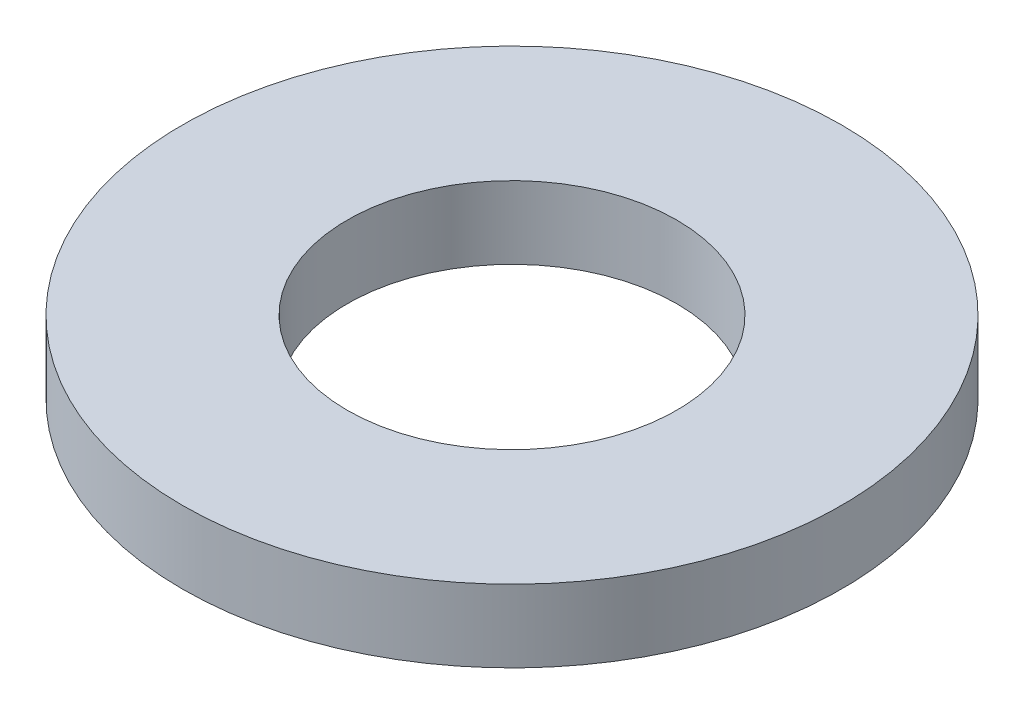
ISO-10303-21;
HEADER;
FILE_DESCRIPTION(('STEP AP214'),'2;1');
FILE_NAME('part.step','',(''),(''),'','','');
FILE_SCHEMA(('AUTOMOTIVE_DESIGN { 1 0 10303 214 1 1 1 1 }'));
ENDSEC;
DATA;
#1=APPLICATION_CONTEXT('core data for automotive mechanical design processes');
#2=APPLICATION_PROTOCOL_DEFINITION('international standard','automotive_design',2000,#1);
#3=PRODUCT_CONTEXT('',#1,'mechanical');
#4=PRODUCT('Part','Part','',(#3));
#5=PRODUCT_RELATED_PRODUCT_CATEGORY('part','',(#4));
#6=PRODUCT_DEFINITION_FORMATION('','',#4);
#7=PRODUCT_DEFINITION_CONTEXT('part definition',#1,'design');
#8=PRODUCT_DEFINITION('design','',#6,#7);
#9=PRODUCT_DEFINITION_SHAPE('','',#8);
#10=(LENGTH_UNIT() NAMED_UNIT(*) SI_UNIT(.MILLI.,.METRE.));
#11=(NAMED_UNIT(*) PLANE_ANGLE_UNIT() SI_UNIT($,.RADIAN.));
#12=(NAMED_UNIT(*) SI_UNIT($,.STERADIAN.) SOLID_ANGLE_UNIT());
#13=UNCERTAINTY_MEASURE_WITH_UNIT(LENGTH_MEASURE(1.E-05),#10,'distance_accuracy_value','');
#14=(GEOMETRIC_REPRESENTATION_CONTEXT(3) GLOBAL_UNCERTAINTY_ASSIGNED_CONTEXT((#13)) GLOBAL_UNIT_ASSIGNED_CONTEXT((#10,
#11,#12)) REPRESENTATION_CONTEXT('',''));
#15=CARTESIAN_POINT('',(0.,0.,0.));
#16=DIRECTION('',(0.,0.,1.));
#17=DIRECTION('',(1.,0.,0.));
#18=AXIS2_PLACEMENT_3D('',#15,#16,#17);
#19=CARTESIAN_POINT('',(0.,0.,0.));
#20=DIRECTION('',(0.,-1.,0.));
#21=DIRECTION('',(0.,0.,-1.));
#22=AXIS2_PLACEMENT_3D('',#19,#20,#21);
#23=CYLINDRICAL_SURFACE('',#22,5.);
#24=CARTESIAN_POINT('',(0.,0.,0.));
#25=DIRECTION('',(0.,-1.,0.));
#26=DIRECTION('',(0.,0.,-1.));
#27=AXIS2_PLACEMENT_3D('',#24,#25,#26);
#28=CIRCLE('',#27,5.);
#29=CARTESIAN_POINT('',(0.,0.,-5.00000000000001));
#30=VERTEX_POINT('',#29);
#31=EDGE_CURVE('E46',#30,#30,#28,.T.);
#32=ORIENTED_EDGE('',*,*,#31,.T.);
#33=EDGE_LOOP('',(#32));
#34=FACE_BOUND('',#33,.T.);
#35=CARTESIAN_POINT('',(0.,2.20000000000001,0.));
#36=DIRECTION('',(0.,-1.,0.));
#37=DIRECTION('',(0.,0.,-1.));
#38=AXIS2_PLACEMENT_3D('',#35,#36,#37);
#39=CIRCLE('',#38,5.);
#40=CARTESIAN_POINT('',(0.,2.20000000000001,-5.00000000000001));
#41=VERTEX_POINT('',#40);
#42=EDGE_CURVE('E10',#41,#41,#39,.T.);
#43=ORIENTED_EDGE('',*,*,#42,.F.);
#44=EDGE_LOOP('',(#43));
#45=FACE_BOUND('',#44,.T.);
#46=ADVANCED_FACE('F32',(#34,#45),#23,.F.);
#47=CARTESIAN_POINT('',(5.00000000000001,2.20000000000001,0.));
#48=DIRECTION('',(0.,1.,0.));
#49=DIRECTION('',(0.,0.,1.));
#50=AXIS2_PLACEMENT_3D('',#47,#48,#49);
#51=PLANE('',#50);
#52=ORIENTED_EDGE('',*,*,#42,.T.);
#53=EDGE_LOOP('',(#52));
#54=FACE_BOUND('',#53,.T.);
#55=CARTESIAN_POINT('',(0.,2.20000000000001,0.));
#56=DIRECTION('',(0.,-1.,0.));
#57=DIRECTION('',(0.,0.,-1.));
#58=AXIS2_PLACEMENT_3D('',#55,#56,#57);
#59=CIRCLE('',#58,10.);
#60=CARTESIAN_POINT('',(0.,2.20000000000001,-10.));
#61=VERTEX_POINT('',#60);
#62=EDGE_CURVE('E38',#61,#61,#59,.T.);
#63=ORIENTED_EDGE('',*,*,#62,.F.);
#64=EDGE_LOOP('',(#63));
#65=FACE_BOUND('',#64,.T.);
#66=ADVANCED_FACE('F62',(#54,#65),#51,.T.);
#67=CARTESIAN_POINT('',(0.,0.,0.));
#68=DIRECTION('',(0.,-1.,0.));
#69=DIRECTION('',(0.,0.,-1.));
#70=AXIS2_PLACEMENT_3D('',#67,#68,#69);
#71=CYLINDRICAL_SURFACE('',#70,10.);
#72=ORIENTED_EDGE('',*,*,#62,.T.);
#73=EDGE_LOOP('',(#72));
#74=FACE_BOUND('',#73,.T.);
#75=CARTESIAN_POINT('',(0.,0.,0.));
#76=DIRECTION('',(0.,-1.,0.));
#77=DIRECTION('',(0.,0.,-1.));
#78=AXIS2_PLACEMENT_3D('',#75,#76,#77);
#79=CIRCLE('',#78,10.);
#80=CARTESIAN_POINT('',(0.,0.,-10.));
#81=VERTEX_POINT('',#80);
#82=EDGE_CURVE('E42',#81,#81,#79,.T.);
#83=ORIENTED_EDGE('',*,*,#82,.F.);
#84=EDGE_LOOP('',(#83));
#85=FACE_BOUND('',#84,.T.);
#86=ADVANCED_FACE('F56',(#74,#85),#71,.T.);
#87=CARTESIAN_POINT('',(5.00000000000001,0.,0.));
#88=DIRECTION('',(0.,-1.,0.));
#89=DIRECTION('',(0.,0.,-1.));
#90=AXIS2_PLACEMENT_3D('',#87,#88,#89);
#91=PLANE('',#90);
#92=ORIENTED_EDGE('',*,*,#82,.T.);
#93=EDGE_LOOP('',(#92));
#94=FACE_BOUND('',#93,.T.);
#95=ORIENTED_EDGE('',*,*,#31,.F.);
#96=EDGE_LOOP('',(#95));
#97=FACE_BOUND('',#96,.T.);
#98=ADVANCED_FACE('F54',(#94,#97),#91,.T.);
#99=CLOSED_SHELL('',(#46,#66,#86,#98));
#100=MANIFOLD_SOLID_BREP('B2',#99);
#101=ADVANCED_BREP_SHAPE_REPRESENTATION('',(#18,#100),#14);
#102=SHAPE_DEFINITION_REPRESENTATION(#9,#101);
ENDSEC;
END-ISO-10303-21;
